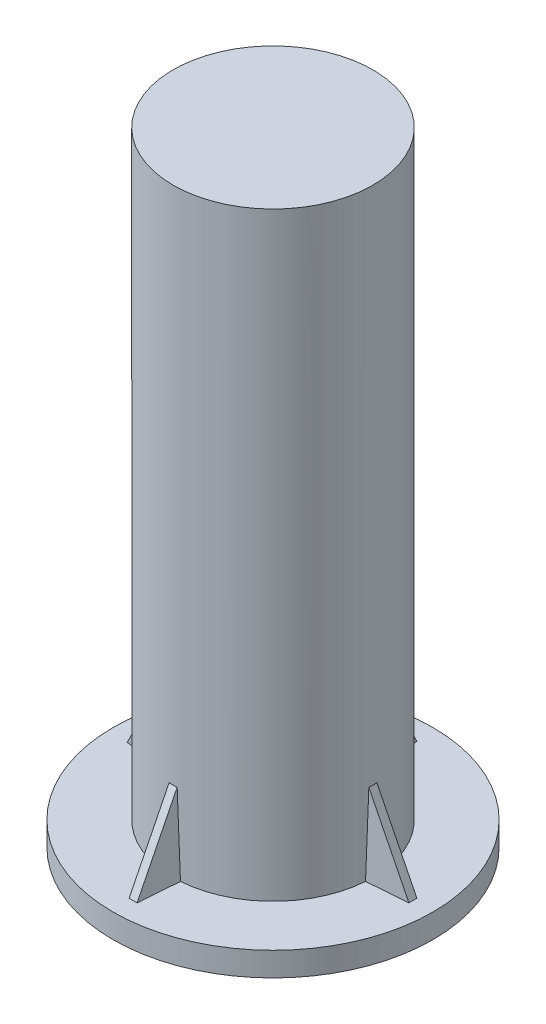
ISO-10303-21;
HEADER;
FILE_DESCRIPTION(('STEP AP214'),'2;1');
FILE_NAME('part.step','',(''),(''),'','','');
FILE_SCHEMA(('AUTOMOTIVE_DESIGN { 1 0 10303 214 1 1 1 1 }'));
ENDSEC;
DATA;
#1=APPLICATION_CONTEXT('core data for automotive mechanical design processes');
#2=APPLICATION_PROTOCOL_DEFINITION('international standard','automotive_design',2000,#1);
#3=PRODUCT_CONTEXT('',#1,'mechanical');
#4=PRODUCT('Part','Part','',(#3));
#5=PRODUCT_RELATED_PRODUCT_CATEGORY('part','',(#4));
#6=PRODUCT_DEFINITION_FORMATION('','',#4);
#7=PRODUCT_DEFINITION_CONTEXT('part definition',#1,'design');
#8=PRODUCT_DEFINITION('design','',#6,#7);
#9=PRODUCT_DEFINITION_SHAPE('','',#8);
#10=(LENGTH_UNIT() NAMED_UNIT(*) SI_UNIT(.MILLI.,.METRE.));
#11=(NAMED_UNIT(*) PLANE_ANGLE_UNIT() SI_UNIT($,.RADIAN.));
#12=(NAMED_UNIT(*) SI_UNIT($,.STERADIAN.) SOLID_ANGLE_UNIT());
#13=UNCERTAINTY_MEASURE_WITH_UNIT(LENGTH_MEASURE(1.E-05),#10,'distance_accuracy_value','');
#14=(GEOMETRIC_REPRESENTATION_CONTEXT(3) GLOBAL_UNCERTAINTY_ASSIGNED_CONTEXT((#13)) GLOBAL_UNIT_ASSIGNED_CONTEXT((#10,
#11,#12)) REPRESENTATION_CONTEXT('',''));
#15=CARTESIAN_POINT('',(0.,0.,0.));
#16=DIRECTION('',(0.,0.,1.));
#17=DIRECTION('',(1.,0.,0.));
#18=AXIS2_PLACEMENT_3D('',#15,#16,#17);
#19=CARTESIAN_POINT('',(0.,6.,0.));
#20=DIRECTION('',(0.,1.,0.));
#21=DIRECTION('',(0.,0.,1.));
#22=AXIS2_PLACEMENT_3D('',#19,#20,#21);
#23=PLANE('',#22);
#24=DIRECTION('',(0.996952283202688,0.,-0.0780137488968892));
#25=VECTOR('',#24,1.);
#26=CARTESIAN_POINT('',(0.290791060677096,6.,3.71607333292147));
#27=LINE('',#26,#25);
#28=CARTESIAN_POINT('',(24.9360128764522,6.,1.78752953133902));
#29=VERTEX_POINT('',#28);
#30=CARTESIAN_POINT('',(35.,6.,1.));
#31=VERTEX_POINT('',#30);
#32=EDGE_CURVE('E189',#29,#31,#27,.T.);
#33=ORIENTED_EDGE('',*,*,#32,.F.);
#34=CARTESIAN_POINT('',(0.,6.,0.));
#35=DIRECTION('',(0.,1.,0.));
#36=DIRECTION('',(0.,0.,1.));
#37=AXIS2_PLACEMENT_3D('',#34,#35,#36);
#38=CIRCLE('',#37,25.);
#39=CARTESIAN_POINT('',(1.78752953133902,6.,24.9360128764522));
#40=VERTEX_POINT('',#39);
#41=EDGE_CURVE('E226',#40,#29,#38,.T.);
#42=ORIENTED_EDGE('',*,*,#41,.F.);
#43=DIRECTION('',(0.0780137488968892,0.,-0.996952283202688));
#44=VECTOR('',#43,1.);
#45=CARTESIAN_POINT('',(3.71607333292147,6.,0.290791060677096));
#46=LINE('',#45,#44);
#47=CARTESIAN_POINT('',(1.,6.,35.));
#48=VERTEX_POINT('',#47);
#49=EDGE_CURVE('E170',#48,#40,#46,.T.);
#50=ORIENTED_EDGE('',*,*,#49,.F.);
#51=DIRECTION('',(-1.,0.,0.));
#52=VECTOR('',#51,1.);
#53=CARTESIAN_POINT('',(0.,6.,35.));
#54=LINE('',#53,#52);
#55=CARTESIAN_POINT('',(-0.999999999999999,6.,35.));
#56=VERTEX_POINT('',#55);
#57=EDGE_CURVE('E174',#56,#48,#54,.F.);
#58=ORIENTED_EDGE('',*,*,#57,.F.);
#59=DIRECTION('',(-0.0780137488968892,0.,-0.996952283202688));
#60=VECTOR('',#59,1.);
#61=CARTESIAN_POINT('',(-3.71607333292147,6.,0.290791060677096));
#62=LINE('',#61,#60);
#63=CARTESIAN_POINT('',(-1.78752953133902,6.,24.9360128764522));
#64=VERTEX_POINT('',#63);
#65=EDGE_CURVE('E163',#56,#64,#62,.T.);
#66=ORIENTED_EDGE('',*,*,#65,.T.);
#67=CARTESIAN_POINT('',(-24.8948278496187,6.,2.29075235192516));
#68=VERTEX_POINT('',#67);
#69=EDGE_CURVE('E223',#68,#64,#38,.T.);
#70=ORIENTED_EDGE('',*,*,#69,.F.);
#71=DIRECTION('',(0.996952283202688,0.,0.0780137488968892));
#72=VECTOR('',#71,1.);
#73=CARTESIAN_POINT('',(-0.329679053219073,6.,4.213030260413));
#74=LINE('',#73,#72);
#75=CARTESIAN_POINT('',(-35.,6.,1.5));
#76=VERTEX_POINT('',#75);
#77=EDGE_CURVE('E209',#76,#68,#74,.T.);
#78=ORIENTED_EDGE('',*,*,#77,.F.);
#79=DIRECTION('',(0.,0.,-1.));
#80=VECTOR('',#79,1.);
#81=CARTESIAN_POINT('',(-35.,6.,0.));
#82=LINE('',#81,#80);
#83=CARTESIAN_POINT('',(-35.,6.,-1.5));
#84=VERTEX_POINT('',#83);
#85=EDGE_CURVE('E213',#84,#76,#82,.F.);
#86=ORIENTED_EDGE('',*,*,#85,.F.);
#87=DIRECTION('',(0.996952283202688,0.,-0.0780137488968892));
#88=VECTOR('',#87,1.);
#89=CARTESIAN_POINT('',(-0.329679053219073,6.,-4.213030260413));
#90=LINE('',#89,#88);
#91=CARTESIAN_POINT('',(-24.8948278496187,6.,-2.29075235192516));
#92=VERTEX_POINT('',#91);
#93=EDGE_CURVE('E202',#84,#92,#90,.T.);
#94=ORIENTED_EDGE('',*,*,#93,.T.);
#95=CARTESIAN_POINT('',(-1.78752953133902,6.,-24.9360128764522));
#96=VERTEX_POINT('',#95);
#97=EDGE_CURVE('E217',#96,#92,#38,.T.);
#98=ORIENTED_EDGE('',*,*,#97,.F.);
#99=DIRECTION('',(0.0780137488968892,0.,-0.996952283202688));
#100=VECTOR('',#99,1.);
#101=CARTESIAN_POINT('',(-3.71607333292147,6.,-0.290791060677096));
#102=LINE('',#101,#100);
#103=CARTESIAN_POINT('',(-1.,6.,-35.));
#104=VERTEX_POINT('',#103);
#105=EDGE_CURVE('E60',#96,#104,#102,.T.);
#106=ORIENTED_EDGE('',*,*,#105,.T.);
#107=DIRECTION('',(-1.,0.,0.));
#108=VECTOR('',#107,1.);
#109=CARTESIAN_POINT('',(0.,6.,-35.));
#110=LINE('',#109,#108);
#111=CARTESIAN_POINT('',(1.,6.,-35.));
#112=VERTEX_POINT('',#111);
#113=EDGE_CURVE('E55',#112,#104,#110,.T.);
#114=ORIENTED_EDGE('',*,*,#113,.F.);
#115=DIRECTION('',(-0.0780137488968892,0.,-0.996952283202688));
#116=VECTOR('',#115,1.);
#117=CARTESIAN_POINT('',(3.71607333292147,6.,-0.290791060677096));
#118=LINE('',#117,#116);
#119=CARTESIAN_POINT('',(1.78752953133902,6.,-24.9360128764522));
#120=VERTEX_POINT('',#119);
#121=EDGE_CURVE('E153',#120,#112,#118,.T.);
#122=ORIENTED_EDGE('',*,*,#121,.F.);
#123=CARTESIAN_POINT('',(24.9360128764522,6.,-1.78752953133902));
#124=VERTEX_POINT('',#123);
#125=EDGE_CURVE('E227',#124,#120,#38,.T.);
#126=ORIENTED_EDGE('',*,*,#125,.F.);
#127=DIRECTION('',(0.996952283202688,0.,0.0780137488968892));
#128=VECTOR('',#127,1.);
#129=CARTESIAN_POINT('',(0.290791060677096,6.,-3.71607333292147));
#130=LINE('',#129,#128);
#131=CARTESIAN_POINT('',(35.,6.,-1.));
#132=VERTEX_POINT('',#131);
#133=EDGE_CURVE('E183',#124,#132,#130,.T.);
#134=ORIENTED_EDGE('',*,*,#133,.T.);
#135=DIRECTION('',(0.,0.,-1.));
#136=VECTOR('',#135,1.);
#137=CARTESIAN_POINT('',(35.,6.,0.));
#138=LINE('',#137,#136);
#139=EDGE_CURVE('E193',#31,#132,#138,.T.);
#140=ORIENTED_EDGE('',*,*,#139,.F.);
#141=EDGE_LOOP('',(#33,#42,#50,#58,#66,#70,#78,#86,#94,#98,#106,#114,#122,#126,#134,#140));
#142=FACE_BOUND('',#141,.T.);
#143=CARTESIAN_POINT('',(0.,6.,0.));
#144=DIRECTION('',(0.,1.,0.));
#145=DIRECTION('',(0.,0.,1.));
#146=AXIS2_PLACEMENT_3D('',#143,#144,#145);
#147=CIRCLE('',#146,40.);
#148=CARTESIAN_POINT('',(0.,6.,40.));
#149=VERTEX_POINT('',#148);
#150=EDGE_CURVE('E236',#149,#149,#147,.T.);
#151=ORIENTED_EDGE('',*,*,#150,.T.);
#152=EDGE_LOOP('',(#151));
#153=FACE_BOUND('',#152,.T.);
#154=ADVANCED_FACE('F39',(#142,#153),#23,.T.);
#155=CARTESIAN_POINT('',(0.,0.,0.));
#156=DIRECTION('',(0.,1.,0.));
#157=DIRECTION('',(0.,0.,1.));
#158=AXIS2_PLACEMENT_3D('',#155,#156,#157);
#159=PLANE('',#158);
#160=CARTESIAN_POINT('',(0.,0.,0.));
#161=DIRECTION('',(0.,1.,0.));
#162=DIRECTION('',(0.,0.,1.));
#163=AXIS2_PLACEMENT_3D('',#160,#161,#162);
#164=CIRCLE('',#163,5.);
#165=CARTESIAN_POINT('',(0.,0.,5.));
#166=VERTEX_POINT('',#165);
#167=EDGE_CURVE('E231',#166,#166,#164,.T.);
#168=ORIENTED_EDGE('',*,*,#167,.T.);
#169=EDGE_LOOP('',(#168));
#170=FACE_BOUND('',#169,.T.);
#171=CARTESIAN_POINT('',(0.,0.,0.));
#172=DIRECTION('',(0.,1.,0.));
#173=DIRECTION('',(0.,0.,1.));
#174=AXIS2_PLACEMENT_3D('',#171,#172,#173);
#175=CIRCLE('',#174,40.);
#176=CARTESIAN_POINT('',(0.,0.,40.));
#177=VERTEX_POINT('',#176);
#178=EDGE_CURVE('E235',#177,#177,#175,.T.);
#179=ORIENTED_EDGE('',*,*,#178,.F.);
#180=EDGE_LOOP('',(#179));
#181=FACE_BOUND('',#180,.T.);
#182=ADVANCED_FACE('F310',(#170,#181),#159,.F.);
#183=CARTESIAN_POINT('',(0.,6.,0.));
#184=DIRECTION('',(0.,-1.,0.));
#185=DIRECTION('',(0.,0.,-1.));
#186=AXIS2_PLACEMENT_3D('',#183,#184,#185);
#187=CYLINDRICAL_SURFACE('',#186,40.);
#188=ORIENTED_EDGE('',*,*,#178,.T.);
#189=EDGE_LOOP('',(#188));
#190=FACE_BOUND('',#189,.T.);
#191=ORIENTED_EDGE('',*,*,#150,.F.);
#192=EDGE_LOOP('',(#191));
#193=FACE_BOUND('',#192,.T.);
#194=ADVANCED_FACE('F41',(#190,#193),#187,.T.);
#195=CARTESIAN_POINT('',(0.,6.,0.));
#196=DIRECTION('',(0.,-1.,0.));
#197=DIRECTION('',(0.,0.,-1.));
#198=AXIS2_PLACEMENT_3D('',#195,#196,#197);
#199=CYLINDRICAL_SURFACE('',#198,5.);
#200=CARTESIAN_POINT('',(0.,6.,0.));
#201=DIRECTION('',(0.,1.,0.));
#202=DIRECTION('',(0.,0.,1.));
#203=AXIS2_PLACEMENT_3D('',#200,#201,#202);
#204=CIRCLE('',#203,5.);
#205=CARTESIAN_POINT('',(0.,6.,5.));
#206=VERTEX_POINT('',#205);
#207=EDGE_CURVE('E222',#206,#206,#204,.T.);
#208=ORIENTED_EDGE('',*,*,#207,.T.);
#209=EDGE_LOOP('',(#208));
#210=FACE_BOUND('',#209,.T.);
#211=ORIENTED_EDGE('',*,*,#167,.F.);
#212=EDGE_LOOP('',(#211));
#213=FACE_BOUND('',#212,.T.);
#214=ADVANCED_FACE('F317',(#210,#213),#199,.F.);
#215=CARTESIAN_POINT('',(0.,6.,0.));
#216=DIRECTION('',(0.,1.,0.));
#217=DIRECTION('',(0.,0.,1.));
#218=AXIS2_PLACEMENT_3D('',#215,#216,#217);
#219=PLANE('',#218);
#220=ORIENTED_EDGE('',*,*,#207,.F.);
#221=EDGE_LOOP('',(#220));
#222=FACE_BOUND('',#221,.T.);
#223=ADVANCED_FACE('F320',(#222),#219,.F.);
#224=CARTESIAN_POINT('',(0.,156.,0.));
#225=DIRECTION('',(0.,-1.,0.));
#226=DIRECTION('',(0.,0.,-1.));
#227=AXIS2_PLACEMENT_3D('',#224,#225,#226);
#228=CYLINDRICAL_SURFACE('',#227,25.);
#229=ORIENTED_EDGE('',*,*,#41,.T.);
#230=CARTESIAN_POINT('',(0.,101.558373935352,0.));
#231=DIRECTION('',(0.0779544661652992,0.0389772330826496,0.996194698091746));
#232=DIRECTION('',(0.00304076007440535,-0.999240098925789,0.0388584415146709));
#233=AXIS2_PLACEMENT_3D('',#230,#231,#232);
#234=ELLIPSE('',#233,641.400069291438,25.);
#235=CARTESIAN_POINT('',(24.9799919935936,26.0400160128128,1.));
#236=VERTEX_POINT('',#235);
#237=EDGE_CURVE('E261',#29,#236,#234,.T.);
#238=ORIENTED_EDGE('',*,*,#237,.T.);
#239=CARTESIAN_POINT('',(0.,76.,0.));
#240=DIRECTION('',(0.894427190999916,0.447213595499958,0.));
#241=DIRECTION('',(0.447213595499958,-0.894427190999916,0.));
#242=AXIS2_PLACEMENT_3D('',#239,#240,#241);
#243=ELLIPSE('',#242,55.9016994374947,25.);
#244=CARTESIAN_POINT('',(24.9799919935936,26.0400160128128,-1.));
#245=VERTEX_POINT('',#244);
#246=EDGE_CURVE('E258',#236,#245,#243,.T.);
#247=ORIENTED_EDGE('',*,*,#246,.T.);
#248=CARTESIAN_POINT('',(0.,101.558373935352,0.));
#249=DIRECTION('',(-0.0779544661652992,-0.0389772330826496,0.996194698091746));
#250=DIRECTION('',(0.00304076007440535,-0.999240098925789,-0.0388584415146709));
#251=AXIS2_PLACEMENT_3D('',#248,#249,#250);
#252=ELLIPSE('',#251,641.400069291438,25.);
#253=EDGE_CURVE('E254',#124,#245,#252,.T.);
#254=ORIENTED_EDGE('',*,*,#253,.F.);
#255=ORIENTED_EDGE('',*,*,#125,.T.);
#256=CARTESIAN_POINT('',(0.,101.558373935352,0.));
#257=DIRECTION('',(0.996194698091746,0.0389772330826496,-0.0779544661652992));
#258=DIRECTION('',(0.0388584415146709,-0.999240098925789,-0.00304076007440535));
#259=AXIS2_PLACEMENT_3D('',#256,#257,#258);
#260=ELLIPSE('',#259,641.400069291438,25.);
#261=CARTESIAN_POINT('',(1.,26.0400160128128,-24.9799919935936));
#262=VERTEX_POINT('',#261);
#263=EDGE_CURVE('E11',#120,#262,#260,.T.);
#264=ORIENTED_EDGE('',*,*,#263,.T.);
#265=CARTESIAN_POINT('',(0.,76.,0.));
#266=DIRECTION('',(0.,0.447213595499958,-0.894427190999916));
#267=DIRECTION('',(0.,-0.894427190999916,-0.447213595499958));
#268=AXIS2_PLACEMENT_3D('',#265,#266,#267);
#269=ELLIPSE('',#268,55.9016994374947,25.);
#270=CARTESIAN_POINT('',(-1.,26.0400160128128,-24.9799919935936));
#271=VERTEX_POINT('',#270);
#272=EDGE_CURVE('E48',#262,#271,#269,.T.);
#273=ORIENTED_EDGE('',*,*,#272,.T.);
#274=CARTESIAN_POINT('',(0.,101.558373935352,0.));
#275=DIRECTION('',(0.996194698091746,-0.0389772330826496,0.0779544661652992));
#276=DIRECTION('',(-0.0388584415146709,-0.999240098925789,-0.00304076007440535));
#277=AXIS2_PLACEMENT_3D('',#274,#275,#276);
#278=ELLIPSE('',#277,641.400069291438,25.);
#279=EDGE_CURVE('E129',#96,#271,#278,.T.);
#280=ORIENTED_EDGE('',*,*,#279,.F.);
#281=ORIENTED_EDGE('',*,*,#97,.T.);
#282=CARTESIAN_POINT('',(0.,114.337560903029,0.));
#283=DIRECTION('',(0.0779544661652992,-0.0389772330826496,0.996194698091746));
#284=DIRECTION('',(-0.00304076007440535,-0.999240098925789,-0.0388584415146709));
#285=AXIS2_PLACEMENT_3D('',#282,#283,#284);
#286=ELLIPSE('',#285,641.400069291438,25.);
#287=CARTESIAN_POINT('',(-24.9549594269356,26.0900811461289,-1.5));
#288=VERTEX_POINT('',#287);
#289=EDGE_CURVE('E240',#288,#92,#286,.T.);
#290=ORIENTED_EDGE('',*,*,#289,.F.);
#291=CARTESIAN_POINT('',(0.,76.,0.));
#292=DIRECTION('',(0.894427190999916,-0.447213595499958,0.));
#293=DIRECTION('',(-0.447213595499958,-0.894427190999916,0.));
#294=AXIS2_PLACEMENT_3D('',#291,#292,#293);
#295=ELLIPSE('',#294,55.9016994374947,25.);
#296=CARTESIAN_POINT('',(-24.9549594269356,26.0900811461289,1.5));
#297=VERTEX_POINT('',#296);
#298=EDGE_CURVE('E247',#288,#297,#295,.F.);
#299=ORIENTED_EDGE('',*,*,#298,.T.);
#300=CARTESIAN_POINT('',(0.,114.337560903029,0.));
#301=DIRECTION('',(-0.0779544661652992,0.0389772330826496,0.996194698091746));
#302=DIRECTION('',(-0.00304076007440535,-0.999240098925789,0.0388584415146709));
#303=AXIS2_PLACEMENT_3D('',#300,#301,#302);
#304=ELLIPSE('',#303,641.400069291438,25.);
#305=EDGE_CURVE('E250',#297,#68,#304,.T.);
#306=ORIENTED_EDGE('',*,*,#305,.T.);
#307=ORIENTED_EDGE('',*,*,#69,.T.);
#308=CARTESIAN_POINT('',(0.,101.558373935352,0.));
#309=DIRECTION('',(0.996194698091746,-0.0389772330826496,-0.0779544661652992));
#310=DIRECTION('',(-0.0388584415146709,-0.999240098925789,0.00304076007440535));
#311=AXIS2_PLACEMENT_3D('',#308,#309,#310);
#312=ELLIPSE('',#311,641.400069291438,25.);
#313=CARTESIAN_POINT('',(-1.,26.0400160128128,24.9799919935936));
#314=VERTEX_POINT('',#313);
#315=EDGE_CURVE('E264',#314,#64,#312,.T.);
#316=ORIENTED_EDGE('',*,*,#315,.F.);
#317=CARTESIAN_POINT('',(0.,76.,0.));
#318=DIRECTION('',(0.,-0.447213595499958,-0.894427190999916));
#319=DIRECTION('',(0.,-0.894427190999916,0.447213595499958));
#320=AXIS2_PLACEMENT_3D('',#317,#318,#319);
#321=ELLIPSE('',#320,55.9016994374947,25.);
#322=CARTESIAN_POINT('',(1.,26.0400160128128,24.9799919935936));
#323=VERTEX_POINT('',#322);
#324=EDGE_CURVE('E268',#314,#323,#321,.F.);
#325=ORIENTED_EDGE('',*,*,#324,.T.);
#326=CARTESIAN_POINT('',(0.,101.558373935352,0.));
#327=DIRECTION('',(0.996194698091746,0.0389772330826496,0.0779544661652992));
#328=DIRECTION('',(0.0388584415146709,-0.999240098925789,0.00304076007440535));
#329=AXIS2_PLACEMENT_3D('',#326,#327,#328);
#330=ELLIPSE('',#329,641.400069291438,25.);
#331=EDGE_CURVE('E142',#323,#40,#330,.T.);
#332=ORIENTED_EDGE('',*,*,#331,.T.);
#333=EDGE_LOOP('',(#229,#238,#247,#254,#255,#264,#273,#280,#281,#290,#299,#306,#307,#316,#325,#332));
#334=FACE_BOUND('',#333,.T.);
#335=CARTESIAN_POINT('',(0.,156.,0.));
#336=DIRECTION('',(0.,1.,0.));
#337=DIRECTION('',(0.,0.,1.));
#338=AXIS2_PLACEMENT_3D('',#335,#336,#337);
#339=CIRCLE('',#338,25.);
#340=CARTESIAN_POINT('',(0.,156.,25.));
#341=VERTEX_POINT('',#340);
#342=EDGE_CURVE('E218',#341,#341,#339,.T.);
#343=ORIENTED_EDGE('',*,*,#342,.F.);
#344=EDGE_LOOP('',(#343));
#345=FACE_BOUND('',#344,.T.);
#346=ADVANCED_FACE('F127',(#334,#345),#228,.T.);
#347=CARTESIAN_POINT('',(0.,156.,0.));
#348=DIRECTION('',(0.,1.,0.));
#349=DIRECTION('',(0.,0.,1.));
#350=AXIS2_PLACEMENT_3D('',#347,#348,#349);
#351=PLANE('',#350);
#352=ORIENTED_EDGE('',*,*,#342,.T.);
#353=EDGE_LOOP('',(#352));
#354=FACE_BOUND('',#353,.T.);
#355=ADVANCED_FACE('F307',(#354),#351,.T.);
#356=CARTESIAN_POINT('',(-35.,6.00000000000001,0.));
#357=DIRECTION('',(0.894427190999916,-0.447213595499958,0.));
#358=DIRECTION('',(0.447213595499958,0.894427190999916,0.));
#359=AXIS2_PLACEMENT_3D('',#356,#357,#358);
#360=PLANE('',#359);
#361=DIRECTION('',(0.447213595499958,0.894427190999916,0.));
#362=VECTOR('',#361,1.);
#363=CARTESIAN_POINT('',(0.800000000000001,77.6,-1.5));
#364=LINE('',#363,#362);
#365=EDGE_CURVE('E197',#84,#288,#364,.T.);
#366=ORIENTED_EDGE('',*,*,#365,.F.);
#367=ORIENTED_EDGE('',*,*,#85,.T.);
#368=DIRECTION('',(-0.447213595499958,-0.894427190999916,0.));
#369=VECTOR('',#368,1.);
#370=CARTESIAN_POINT('',(-35.,6.00000000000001,1.5));
#371=LINE('',#370,#369);
#372=EDGE_CURVE('E198',#76,#297,#371,.F.);
#373=ORIENTED_EDGE('',*,*,#372,.T.);
#374=ORIENTED_EDGE('',*,*,#298,.F.);
#375=EDGE_LOOP('',(#366,#367,#373,#374));
#376=FACE_BOUND('',#375,.T.);
#377=ADVANCED_FACE('F294',(#376),#360,.F.);
#378=CARTESIAN_POINT('',(0.800000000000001,77.6,1.5));
#379=DIRECTION('',(-0.0779544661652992,0.0389772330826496,0.996194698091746));
#380=DIRECTION('',(0.996952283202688,0.,0.0780137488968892));
#381=AXIS2_PLACEMENT_3D('',#378,#379,#380);
#382=PLANE('',#381);
#383=ORIENTED_EDGE('',*,*,#372,.F.);
#384=ORIENTED_EDGE('',*,*,#77,.T.);
#385=ORIENTED_EDGE('',*,*,#305,.F.);
#386=EDGE_LOOP('',(#383,#384,#385));
#387=FACE_BOUND('',#386,.T.);
#388=ADVANCED_FACE('F296',(#387),#382,.T.);
#389=CARTESIAN_POINT('',(0.800000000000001,77.6,-1.5));
#390=DIRECTION('',(0.0779544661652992,-0.0389772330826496,0.996194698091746));
#391=DIRECTION('',(0.996952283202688,0.,-0.0780137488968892));
#392=AXIS2_PLACEMENT_3D('',#389,#390,#391);
#393=PLANE('',#392);
#394=ORIENTED_EDGE('',*,*,#93,.F.);
#395=ORIENTED_EDGE('',*,*,#365,.T.);
#396=ORIENTED_EDGE('',*,*,#289,.T.);
#397=EDGE_LOOP('',(#394,#395,#396));
#398=FACE_BOUND('',#397,.T.);
#399=ADVANCED_FACE('F298',(#398),#393,.F.);
#400=CARTESIAN_POINT('',(35.,6.,0.));
#401=DIRECTION('',(0.894427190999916,0.447213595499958,0.));
#402=DIRECTION('',(-0.447213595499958,0.894427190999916,0.));
#403=AXIS2_PLACEMENT_3D('',#400,#401,#402);
#404=PLANE('',#403);
#405=DIRECTION('',(-0.447213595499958,0.894427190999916,0.));
#406=VECTOR('',#405,1.);
#407=CARTESIAN_POINT('',(-0.799999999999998,77.6,1.));
#408=LINE('',#407,#406);
#409=EDGE_CURVE('E179',#31,#236,#408,.T.);
#410=ORIENTED_EDGE('',*,*,#409,.F.);
#411=ORIENTED_EDGE('',*,*,#139,.T.);
#412=DIRECTION('',(0.447213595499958,-0.894427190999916,0.));
#413=VECTOR('',#412,1.);
#414=CARTESIAN_POINT('',(35.,6.,-1.));
#415=LINE('',#414,#413);
#416=EDGE_CURVE('E178',#132,#245,#415,.F.);
#417=ORIENTED_EDGE('',*,*,#416,.T.);
#418=ORIENTED_EDGE('',*,*,#246,.F.);
#419=EDGE_LOOP('',(#410,#411,#417,#418));
#420=FACE_BOUND('',#419,.T.);
#421=ADVANCED_FACE('F304',(#420),#404,.T.);
#422=CARTESIAN_POINT('',(-0.799999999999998,77.6,1.));
#423=DIRECTION('',(0.0779544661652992,0.0389772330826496,0.996194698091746));
#424=DIRECTION('',(0.996952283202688,0.,-0.0780137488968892));
#425=AXIS2_PLACEMENT_3D('',#422,#423,#424);
#426=PLANE('',#425);
#427=ORIENTED_EDGE('',*,*,#237,.F.);
#428=ORIENTED_EDGE('',*,*,#32,.T.);
#429=ORIENTED_EDGE('',*,*,#409,.T.);
#430=EDGE_LOOP('',(#427,#428,#429));
#431=FACE_BOUND('',#430,.T.);
#432=ADVANCED_FACE('F357',(#431),#426,.T.);
#433=CARTESIAN_POINT('',(-0.799999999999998,77.6,-1.));
#434=DIRECTION('',(-0.0779544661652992,-0.0389772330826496,0.996194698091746));
#435=DIRECTION('',(0.996952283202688,0.,0.0780137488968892));
#436=AXIS2_PLACEMENT_3D('',#433,#434,#435);
#437=PLANE('',#436);
#438=ORIENTED_EDGE('',*,*,#133,.F.);
#439=ORIENTED_EDGE('',*,*,#253,.T.);
#440=ORIENTED_EDGE('',*,*,#416,.F.);
#441=EDGE_LOOP('',(#438,#439,#440));
#442=FACE_BOUND('',#441,.T.);
#443=ADVANCED_FACE('F367',(#442),#437,.F.);
#444=CARTESIAN_POINT('',(0.,6.00000000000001,35.));
#445=DIRECTION('',(0.,-0.447213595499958,-0.894427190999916));
#446=DIRECTION('',(0.,0.894427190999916,-0.447213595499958));
#447=AXIS2_PLACEMENT_3D('',#444,#445,#446);
#448=PLANE('',#447);
#449=DIRECTION('',(0.,0.894427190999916,-0.447213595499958));
#450=VECTOR('',#449,1.);
#451=CARTESIAN_POINT('',(-1.,77.6,-0.800000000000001));
#452=LINE('',#451,#450);
#453=EDGE_CURVE('E158',#56,#314,#452,.T.);
#454=ORIENTED_EDGE('',*,*,#453,.F.);
#455=ORIENTED_EDGE('',*,*,#57,.T.);
#456=DIRECTION('',(0.,-0.894427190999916,0.447213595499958));
#457=VECTOR('',#456,1.);
#458=CARTESIAN_POINT('',(1.,6.00000000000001,35.));
#459=LINE('',#458,#457);
#460=EDGE_CURVE('E159',#48,#323,#459,.F.);
#461=ORIENTED_EDGE('',*,*,#460,.T.);
#462=ORIENTED_EDGE('',*,*,#324,.F.);
#463=EDGE_LOOP('',(#454,#455,#461,#462));
#464=FACE_BOUND('',#463,.T.);
#465=ADVANCED_FACE('F284',(#464),#448,.F.);
#466=CARTESIAN_POINT('',(1.,77.6,-0.800000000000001));
#467=DIRECTION('',(0.996194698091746,0.0389772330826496,0.0779544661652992));
#468=DIRECTION('',(0.0780137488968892,0.,-0.996952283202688));
#469=AXIS2_PLACEMENT_3D('',#466,#467,#468);
#470=PLANE('',#469);
#471=ORIENTED_EDGE('',*,*,#460,.F.);
#472=ORIENTED_EDGE('',*,*,#49,.T.);
#473=ORIENTED_EDGE('',*,*,#331,.F.);
#474=EDGE_LOOP('',(#471,#472,#473));
#475=FACE_BOUND('',#474,.T.);
#476=ADVANCED_FACE('F281',(#475),#470,.T.);
#477=CARTESIAN_POINT('',(-1.,77.6,-0.800000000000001));
#478=DIRECTION('',(0.996194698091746,-0.0389772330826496,-0.0779544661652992));
#479=DIRECTION('',(-0.0780137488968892,0.,-0.996952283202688));
#480=AXIS2_PLACEMENT_3D('',#477,#478,#479);
#481=PLANE('',#480);
#482=ORIENTED_EDGE('',*,*,#65,.F.);
#483=ORIENTED_EDGE('',*,*,#453,.T.);
#484=ORIENTED_EDGE('',*,*,#315,.T.);
#485=EDGE_LOOP('',(#482,#483,#484));
#486=FACE_BOUND('',#485,.T.);
#487=ADVANCED_FACE('F287',(#486),#481,.F.);
#488=CARTESIAN_POINT('',(0.,6.,-35.));
#489=DIRECTION('',(0.,0.447213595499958,-0.894427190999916));
#490=DIRECTION('',(0.,0.894427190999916,0.447213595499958));
#491=AXIS2_PLACEMENT_3D('',#488,#489,#490);
#492=PLANE('',#491);
#493=DIRECTION('',(0.,0.894427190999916,0.447213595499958));
#494=VECTOR('',#493,1.);
#495=CARTESIAN_POINT('',(1.,77.6,0.799999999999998));
#496=LINE('',#495,#494);
#497=EDGE_CURVE('E146',#112,#262,#496,.T.);
#498=ORIENTED_EDGE('',*,*,#497,.F.);
#499=ORIENTED_EDGE('',*,*,#113,.T.);
#500=DIRECTION('',(0.,-0.894427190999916,-0.447213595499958));
#501=VECTOR('',#500,1.);
#502=CARTESIAN_POINT('',(-1.,6.,-35.));
#503=LINE('',#502,#501);
#504=EDGE_CURVE('E140',#104,#271,#503,.F.);
#505=ORIENTED_EDGE('',*,*,#504,.T.);
#506=ORIENTED_EDGE('',*,*,#272,.F.);
#507=EDGE_LOOP('',(#498,#499,#505,#506));
#508=FACE_BOUND('',#507,.T.);
#509=ADVANCED_FACE('F144',(#508),#492,.T.);
#510=CARTESIAN_POINT('',(1.,77.6,0.799999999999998));
#511=DIRECTION('',(0.996194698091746,0.0389772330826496,-0.0779544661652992));
#512=DIRECTION('',(-0.0780137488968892,0.,-0.996952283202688));
#513=AXIS2_PLACEMENT_3D('',#510,#511,#512);
#514=PLANE('',#513);
#515=ORIENTED_EDGE('',*,*,#263,.F.);
#516=ORIENTED_EDGE('',*,*,#121,.T.);
#517=ORIENTED_EDGE('',*,*,#497,.T.);
#518=EDGE_LOOP('',(#515,#516,#517));
#519=FACE_BOUND('',#518,.T.);
#520=ADVANCED_FACE('F444',(#519),#514,.T.);
#521=CARTESIAN_POINT('',(-1.,77.6,0.799999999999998));
#522=DIRECTION('',(0.996194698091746,-0.0389772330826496,0.0779544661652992));
#523=DIRECTION('',(0.0780137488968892,0.,-0.996952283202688));
#524=AXIS2_PLACEMENT_3D('',#521,#522,#523);
#525=PLANE('',#524);
#526=ORIENTED_EDGE('',*,*,#105,.F.);
#527=ORIENTED_EDGE('',*,*,#279,.T.);
#528=ORIENTED_EDGE('',*,*,#504,.F.);
#529=EDGE_LOOP('',(#526,#527,#528));
#530=FACE_BOUND('',#529,.T.);
#531=ADVANCED_FACE('F139',(#530),#525,.F.);
#532=CLOSED_SHELL('',(#154,#182,#194,#214,#223,#346,#355,#377,#388,#399,#421,#432,#443,#465,
#476,#487,#509,#520,#531));
#533=MANIFOLD_SOLID_BREP('B2',#532);
#534=ADVANCED_BREP_SHAPE_REPRESENTATION('',(#18,#533),#14);
#535=SHAPE_DEFINITION_REPRESENTATION(#9,#534);
ENDSEC;
END-ISO-10303-21;
